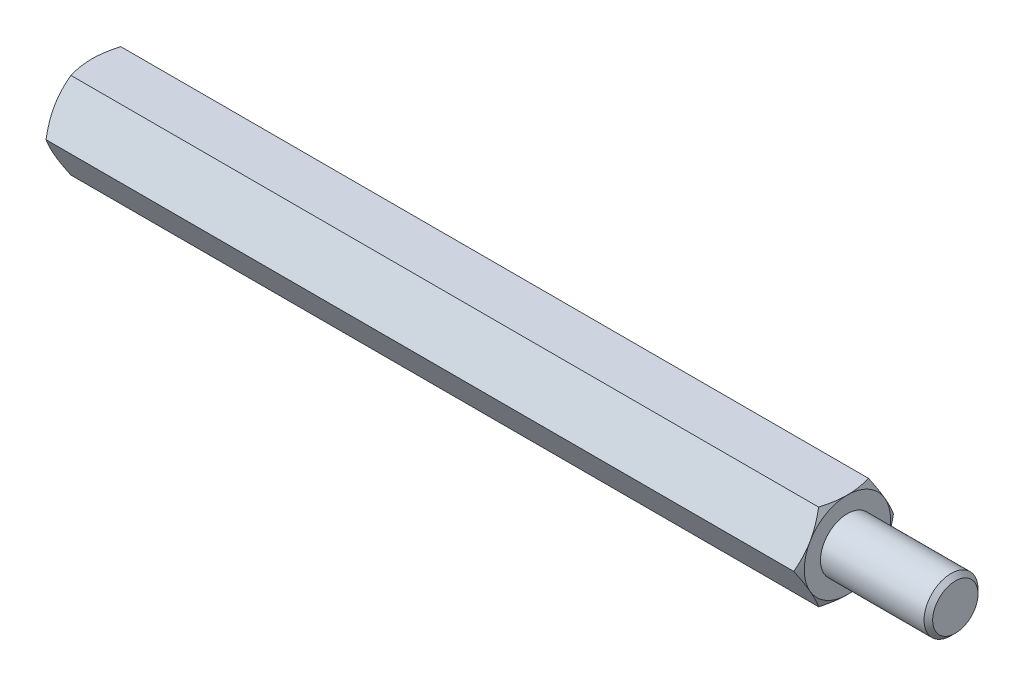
ISO-10303-21;
HEADER;
FILE_DESCRIPTION(('STEP AP214'),'2;1');
FILE_NAME('part.step','',(''),(''),'','','');
FILE_SCHEMA(('AUTOMOTIVE_DESIGN { 1 0 10303 214 1 1 1 1 }'));
ENDSEC;
DATA;
#1=APPLICATION_CONTEXT('core data for automotive mechanical design processes');
#2=APPLICATION_PROTOCOL_DEFINITION('international standard','automotive_design',2000,#1);
#3=PRODUCT_CONTEXT('',#1,'mechanical');
#4=PRODUCT('Part','Part','',(#3));
#5=PRODUCT_RELATED_PRODUCT_CATEGORY('part','',(#4));
#6=PRODUCT_DEFINITION_FORMATION('','',#4);
#7=PRODUCT_DEFINITION_CONTEXT('part definition',#1,'design');
#8=PRODUCT_DEFINITION('design','',#6,#7);
#9=PRODUCT_DEFINITION_SHAPE('','',#8);
#10=(LENGTH_UNIT() NAMED_UNIT(*) SI_UNIT(.MILLI.,.METRE.));
#11=(NAMED_UNIT(*) PLANE_ANGLE_UNIT() SI_UNIT($,.RADIAN.));
#12=(NAMED_UNIT(*) SI_UNIT($,.STERADIAN.) SOLID_ANGLE_UNIT());
#13=UNCERTAINTY_MEASURE_WITH_UNIT(LENGTH_MEASURE(1.E-05),#10,'distance_accuracy_value','');
#14=(GEOMETRIC_REPRESENTATION_CONTEXT(3) GLOBAL_UNCERTAINTY_ASSIGNED_CONTEXT((#13)) GLOBAL_UNIT_ASSIGNED_CONTEXT((#10,
#11,#12)) REPRESENTATION_CONTEXT('',''));
#15=CARTESIAN_POINT('',(0.,0.,0.));
#16=DIRECTION('',(0.,0.,1.));
#17=DIRECTION('',(1.,0.,0.));
#18=AXIS2_PLACEMENT_3D('',#15,#16,#17);
#19=CARTESIAN_POINT('',(35.,4.,-2.3094010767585));
#20=DIRECTION('',(1.,0.,0.));
#21=DIRECTION('',(0.,0.,-1.));
#22=AXIS2_PLACEMENT_3D('',#19,#20,#21);
#23=PLANE('',#22);
#24=CARTESIAN_POINT('',(35.,0.,0.));
#25=DIRECTION('',(1.,0.,0.));
#26=DIRECTION('',(0.,0.,-1.));
#27=AXIS2_PLACEMENT_3D('',#24,#25,#26);
#28=CIRCLE('',#27,4.00000000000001);
#29=CARTESIAN_POINT('',(35.,-2.00000000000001,-3.46410161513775));
#30=VERTEX_POINT('',#29);
#31=CARTESIAN_POINT('',(35.,2.,-3.46410161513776));
#32=VERTEX_POINT('',#31);
#33=EDGE_CURVE('E288',#30,#32,#28,.T.);
#34=ORIENTED_EDGE('',*,*,#33,.T.);
#35=CARTESIAN_POINT('',(35.,4.,0.));
#36=VERTEX_POINT('',#35);
#37=EDGE_CURVE('E53',#32,#36,#28,.T.);
#38=ORIENTED_EDGE('',*,*,#37,.T.);
#39=CARTESIAN_POINT('',(35.,2.,3.46410161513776));
#40=VERTEX_POINT('',#39);
#41=EDGE_CURVE('E297',#36,#40,#28,.T.);
#42=ORIENTED_EDGE('',*,*,#41,.T.);
#43=CARTESIAN_POINT('',(35.,-2.00000000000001,3.46410161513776));
#44=VERTEX_POINT('',#43);
#45=EDGE_CURVE('E303',#40,#44,#28,.T.);
#46=ORIENTED_EDGE('',*,*,#45,.T.);
#47=CARTESIAN_POINT('',(35.,0.,0.));
#48=DIRECTION('',(-1.,0.,0.));
#49=DIRECTION('',(0.,-1.,0.));
#50=AXIS2_PLACEMENT_3D('',#47,#48,#49);
#51=CIRCLE('',#50,4.00000000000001);
#52=CARTESIAN_POINT('',(35.,-4.00000000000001,0.));
#53=VERTEX_POINT('',#52);
#54=EDGE_CURVE('E193',#53,#44,#51,.T.);
#55=ORIENTED_EDGE('',*,*,#54,.F.);
#56=EDGE_CURVE('E61',#53,#30,#28,.T.);
#57=ORIENTED_EDGE('',*,*,#56,.T.);
#58=EDGE_LOOP('',(#34,#38,#42,#46,#55,#57));
#59=FACE_BOUND('',#58,.T.);
#60=CARTESIAN_POINT('',(35.,0.,0.));
#61=DIRECTION('',(1.,0.,0.));
#62=DIRECTION('',(0.,0.,-1.));
#63=AXIS2_PLACEMENT_3D('',#60,#61,#62);
#64=CIRCLE('',#63,2.5);
#65=CARTESIAN_POINT('',(35.,0.,-2.5));
#66=VERTEX_POINT('',#65);
#67=EDGE_CURVE('E384',#66,#66,#64,.T.);
#68=ORIENTED_EDGE('',*,*,#67,.F.);
#69=EDGE_LOOP('',(#68));
#70=FACE_BOUND('',#69,.T.);
#71=ADVANCED_FACE('F37',(#59,#70),#23,.T.);
#72=CARTESIAN_POINT('',(35.,0.,-4.61880215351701));
#73=DIRECTION('',(0.,-0.5,0.866025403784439));
#74=DIRECTION('',(0.,-0.866025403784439,-0.5));
#75=AXIS2_PLACEMENT_3D('',#72,#73,#74);
#76=PLANE('',#75);
#77=CARTESIAN_POINT('',(34.6426677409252,-0.000200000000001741,-4.61891762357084));
#78=CARTESIAN_POINT('',(34.7012821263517,0.175579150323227,-4.5174314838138));
#79=CARTESIAN_POINT('',(34.7545896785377,0.35287561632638,-4.41506932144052));
#80=CARTESIAN_POINT('',(34.8476383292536,0.710538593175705,-4.20857250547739));
#81=CARTESIAN_POINT('',(34.8873465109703,0.890911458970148,-4.10443418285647));
#82=CARTESIAN_POINT('',(34.9491577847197,1.24942181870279,-3.89744813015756));
#83=CARTESIAN_POINT('',(34.9716722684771,1.42750415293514,-3.7946322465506));
#84=CARTESIAN_POINT('',(34.9985493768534,1.7845067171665,-3.58851671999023));
#85=CARTESIAN_POINT('',(35.0029342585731,1.9634256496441,-3.48521782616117));
#86=CARTESIAN_POINT('',(34.99380992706,2.29774284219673,-3.29219970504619));
#87=CARTESIAN_POINT('',(34.982541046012,2.45319115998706,-3.20245157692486));
#88=CARTESIAN_POINT('',(34.9468260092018,2.76307505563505,-3.02354002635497));
#89=CARTESIAN_POINT('',(34.9223676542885,2.91750956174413,-2.93437722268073));
#90=CARTESIAN_POINT('',(34.8612239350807,3.22803232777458,-2.75509682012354));
#91=CARTESIAN_POINT('',(34.8242793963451,3.3840812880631,-2.6650019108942));
#92=CARTESIAN_POINT('',(34.740429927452,3.69385183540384,-2.486155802));
#93=CARTESIAN_POINT('',(34.6935446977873,3.84757739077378,-2.39740231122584));
#94=CARTESIAN_POINT('',(34.6426677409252,4.0002,-2.30928560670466));
#95=B_SPLINE_CURVE_WITH_KNOTS('',3,(#77,#78,#79,#80,#81,#82,#83,#84,#85,#86,#87,#88,#89,#90,#91,
#92,#93,#94),.UNSPECIFIED.,.F.,.F.,(4,2,2,2,2,2,2,2,4),(0.,0.634047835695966,1.26961969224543,
1.88946157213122,2.50854226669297,3.04757825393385,3.58711366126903,4.13861653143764,
4.68903648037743),.UNSPECIFIED.);
#96=CARTESIAN_POINT('',(34.6427344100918,0.,-4.61880215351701));
#97=VERTEX_POINT('',#96);
#98=EDGE_CURVE('E345',#97,#32,#95,.T.);
#99=ORIENTED_EDGE('',*,*,#98,.F.);
#100=DIRECTION('',(-1.,0.,0.));
#101=VECTOR('',#100,1.);
#102=CARTESIAN_POINT('',(35.,0.,-4.61880215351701));
#103=LINE('',#102,#101);
#104=CARTESIAN_POINT('',(-34.6427344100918,0.,-4.61880215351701));
#105=VERTEX_POINT('',#104);
#106=EDGE_CURVE('E264',#97,#105,#103,.T.);
#107=ORIENTED_EDGE('',*,*,#106,.T.);
#108=CARTESIAN_POINT('',(-34.6426677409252,4.0002,-2.30928560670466));
#109=CARTESIAN_POINT('',(-34.7012821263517,3.82442084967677,-2.4107717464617));
#110=CARTESIAN_POINT('',(-34.7545896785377,3.64712438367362,-2.51313390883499));
#111=CARTESIAN_POINT('',(-34.8476383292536,3.28946140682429,-2.71963072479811));
#112=CARTESIAN_POINT('',(-34.8873465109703,3.10908854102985,-2.82376904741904));
#113=CARTESIAN_POINT('',(-34.9491577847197,2.75057818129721,-3.03075510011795));
#114=CARTESIAN_POINT('',(-34.9716722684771,2.57249584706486,-3.13357098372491));
#115=CARTESIAN_POINT('',(-34.9985493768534,2.21549328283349,-3.33968651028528));
#116=CARTESIAN_POINT('',(-35.0029342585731,2.0365743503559,-3.44298540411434));
#117=CARTESIAN_POINT('',(-34.99380992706,1.70225715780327,-3.63600352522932));
#118=CARTESIAN_POINT('',(-34.982541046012,1.54680884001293,-3.72575165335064));
#119=CARTESIAN_POINT('',(-34.9468260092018,1.23692494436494,-3.90466320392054));
#120=CARTESIAN_POINT('',(-34.9223676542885,1.08249043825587,-3.99382600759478));
#121=CARTESIAN_POINT('',(-34.8612239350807,0.771967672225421,-4.17310641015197));
#122=CARTESIAN_POINT('',(-34.8242793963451,0.615918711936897,-4.26320131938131));
#123=CARTESIAN_POINT('',(-34.740429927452,0.30614816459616,-4.4420474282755));
#124=CARTESIAN_POINT('',(-34.6935446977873,0.152422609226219,-4.53080091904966));
#125=CARTESIAN_POINT('',(-34.6426677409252,-0.000200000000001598,-4.61891762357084));
#126=B_SPLINE_CURVE_WITH_KNOTS('',3,(#108,#109,#110,#111,#112,#113,#114,#115,#116,#117,#118,
#119,#120,#121,#122,#123,#124,#125),.UNSPECIFIED.,.F.,.F.,(4,2,2,2,2,2,2,2,4),(0.,
0.634047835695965,1.26961969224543,1.88946157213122,2.50854226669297,3.04757825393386,
3.58711366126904,4.13861653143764,4.68903648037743),.UNSPECIFIED.);
#127=CARTESIAN_POINT('',(-35.,2.,-3.46410161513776));
#128=VERTEX_POINT('',#127);
#129=EDGE_CURVE('E408',#128,#105,#126,.T.);
#130=ORIENTED_EDGE('',*,*,#129,.F.);
#131=CARTESIAN_POINT('',(-34.6427344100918,4.,-2.3094010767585));
#132=VERTEX_POINT('',#131);
#133=EDGE_CURVE('E406',#132,#128,#126,.T.);
#134=ORIENTED_EDGE('',*,*,#133,.F.);
#135=DIRECTION('',(-1.,0.,0.));
#136=VECTOR('',#135,1.);
#137=CARTESIAN_POINT('',(35.,4.,-2.3094010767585));
#138=LINE('',#137,#136);
#139=CARTESIAN_POINT('',(34.642734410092,4.,-2.30940107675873));
#140=VERTEX_POINT('',#139);
#141=EDGE_CURVE('E279',#140,#132,#138,.T.);
#142=ORIENTED_EDGE('',*,*,#141,.F.);
#143=EDGE_CURVE('E229',#32,#140,#95,.T.);
#144=ORIENTED_EDGE('',*,*,#143,.F.);
#145=EDGE_LOOP('',(#99,#107,#130,#134,#142,#144));
#146=FACE_BOUND('',#145,.T.);
#147=ADVANCED_FACE('F148',(#146),#76,.F.);
#148=CARTESIAN_POINT('',(35.,4.,-2.3094010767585));
#149=DIRECTION('',(0.,-1.,0.));
#150=DIRECTION('',(0.,0.,-1.));
#151=AXIS2_PLACEMENT_3D('',#148,#149,#150);
#152=PLANE('',#151);
#153=CARTESIAN_POINT('',(33.0082907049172,4.,-6.28479524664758));
#154=CARTESIAN_POINT('',(33.0937006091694,4.,-6.1093934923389));
#155=CARTESIAN_POINT('',(33.1783148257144,4.,-5.93359774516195));
#156=CARTESIAN_POINT('',(33.3455059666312,4.,-5.58100905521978));
#157=CARTESIAN_POINT('',(33.4280825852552,4.,-5.40421596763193));
#158=CARTESIAN_POINT('',(33.5911508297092,4.,-5.0485508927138));
#159=CARTESIAN_POINT('',(33.6716293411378,4.,-4.86967287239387));
#160=CARTESIAN_POINT('',(33.829400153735,4.,-4.51052237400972));
#161=CARTESIAN_POINT('',(33.906692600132,4.,-4.33024995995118));
#162=CARTESIAN_POINT('',(34.059802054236,4.,-3.9618911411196));
#163=CARTESIAN_POINT('',(34.135480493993,4.,-3.77374683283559));
#164=CARTESIAN_POINT('',(34.2813045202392,4.,-3.39528725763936));
#165=CARTESIAN_POINT('',(34.3514494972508,4.,-3.20497175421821));
#166=CARTESIAN_POINT('',(34.4844245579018,4.,-2.82219775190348));
#167=CARTESIAN_POINT('',(34.5472687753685,4.,-2.62974421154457));
#168=CARTESIAN_POINT('',(34.6636796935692,4.,-2.24207725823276));
#169=CARTESIAN_POINT('',(34.7172492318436,4.,-2.04686470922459));
#170=CARTESIAN_POINT('',(34.8123031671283,4.,-1.65467425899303));
#171=CARTESIAN_POINT('',(34.8538563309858,4.,-1.45771333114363));
#172=CARTESIAN_POINT('',(34.9225903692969,4.,-1.06125849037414));
#173=CARTESIAN_POINT('',(34.9497727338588,4.,-0.861764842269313));
#174=CARTESIAN_POINT('',(34.9872447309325,4.,-0.463879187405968));
#175=CARTESIAN_POINT('',(34.9977578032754,4.,-0.265508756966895));
#176=CARTESIAN_POINT('',(35.0015934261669,4.,0.131417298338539));
#177=CARTESIAN_POINT('',(34.9949158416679,4.,0.329972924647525));
#178=CARTESIAN_POINT('',(34.9696489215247,4.,0.664692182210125));
#179=CARTESIAN_POINT('',(34.9553708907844,4.,0.8012029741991));
#180=CARTESIAN_POINT('',(34.9195349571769,4.,1.07327201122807));
#181=CARTESIAN_POINT('',(34.8979761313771,4.,1.20883013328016));
#182=CARTESIAN_POINT('',(34.8235066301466,4.,1.61386939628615));
#183=CARTESIAN_POINT('',(34.7608149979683,4.,1.88157484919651));
#184=CARTESIAN_POINT('',(34.6515117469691,4.,2.28197262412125));
#185=CARTESIAN_POINT('',(34.612009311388,4.,2.41672443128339));
#186=CARTESIAN_POINT('',(34.5287523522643,4.,2.68492067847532));
#187=CARTESIAN_POINT('',(34.4849977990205,4.,2.81836510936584));
#188=CARTESIAN_POINT('',(34.3939510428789,4.,3.08398596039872));
#189=CARTESIAN_POINT('',(34.346659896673,4.,3.21616274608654));
#190=CARTESIAN_POINT('',(34.2491111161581,4.,3.47941134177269));
#191=CARTESIAN_POINT('',(34.1988535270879,4.,3.61048316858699));
#192=CARTESIAN_POINT('',(34.0713295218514,4.,3.93385125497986));
#193=CARTESIAN_POINT('',(33.9926014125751,4.,4.12557021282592));
#194=CARTESIAN_POINT('',(33.8309693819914,4.,4.50724553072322));
#195=CARTESIAN_POINT('',(33.7480651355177,4.,4.69720175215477));
#196=CARTESIAN_POINT('',(33.5789699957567,4.,5.07569950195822));
#197=CARTESIAN_POINT('',(33.4927782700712,4.,5.26424065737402));
#198=CARTESIAN_POINT('',(33.3178011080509,4.,5.64011758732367));
#199=CARTESIAN_POINT('',(33.2290156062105,4.,5.82745333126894));
#200=CARTESIAN_POINT('',(32.9593432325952,4.,6.38844423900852));
#201=CARTESIAN_POINT('',(32.7753561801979,4.,6.76060781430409));
#202=CARTESIAN_POINT('',(32.4019562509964,4.,7.50211228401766));
#203=CARTESIAN_POINT('',(32.2125442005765,4.,7.87145359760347));
#204=CARTESIAN_POINT('',(31.8473877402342,4.,8.57450173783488));
#205=CARTESIAN_POINT('',(31.671975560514,4.,8.90838144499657));
#206=CARTESIAN_POINT('',(31.3188097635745,4.,9.57491712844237));
#207=CARTESIAN_POINT('',(31.1410560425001,4.,9.90757304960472));
#208=CARTESIAN_POINT('',(30.7842933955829,4.,10.5709822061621));
#209=CARTESIAN_POINT('',(30.6052895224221,3.99999999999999,10.9017381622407));
#210=CARTESIAN_POINT('',(30.2459071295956,3.99999999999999,11.5624752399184));
#211=CARTESIAN_POINT('',(30.0655286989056,3.99999999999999,11.8924564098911));
#212=CARTESIAN_POINT('',(29.884642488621,3.99999999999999,12.2221569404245));
#213=B_SPLINE_CURVE_WITH_KNOTS('',3,(#153,#154,#155,#156,#157,#158,#159,#160,#161,#162,#163,
#164,#165,#166,#167,#168,#169,#170,#171,#172,#173,#174,#175,#176,#177,#178,#179,#180,#181,#182,
#183,#184,#185,#186,#187,#188,#189,#190,#191,#192,#193,#194,#195,#196,#197,#198,#199,#200,#201,
#202,#203,#204,#205,#206,#207,#208,#209,#210,#211,#212),.UNSPECIFIED.,.F.,.F.,(4,2,2,2,2,2,2,2,
2,2,2,2,2,2,2,2,2,2,2,2,2,2,2,2,2,2,2,2,2,4),(0.,0.58528075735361,1.17064881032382,
1.75906864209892,2.34746162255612,2.95577704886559,3.56415938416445,4.17134357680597,
4.77834167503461,5.38179402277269,5.98518378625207,6.5804150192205,7.17565092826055,
7.58721910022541,7.99883946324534,8.82250155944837,9.24373134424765,9.66496407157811,
10.086071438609,10.5071723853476,11.1288656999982,11.7506074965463,12.3725077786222,
12.9944237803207,14.2398211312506,15.4850297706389,16.6164791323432,17.7479788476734,
18.8762380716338,20.0044248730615),.UNSPECIFIED.);
#214=EDGE_CURVE('E227',#140,#36,#213,.T.);
#215=ORIENTED_EDGE('',*,*,#214,.F.);
#216=ORIENTED_EDGE('',*,*,#141,.T.);
#217=CARTESIAN_POINT('',(-33.0082907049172,4.,-6.28479524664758));
#218=CARTESIAN_POINT('',(-33.0937006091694,4.,-6.1093934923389));
#219=CARTESIAN_POINT('',(-33.1783148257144,4.,-5.93359774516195));
#220=CARTESIAN_POINT('',(-33.3455059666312,4.,-5.58100905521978));
#221=CARTESIAN_POINT('',(-33.4280825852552,4.,-5.40421596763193));
#222=CARTESIAN_POINT('',(-33.5911508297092,4.,-5.0485508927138));
#223=CARTESIAN_POINT('',(-33.6716293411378,4.,-4.86967287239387));
#224=CARTESIAN_POINT('',(-33.829400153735,4.,-4.51052237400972));
#225=CARTESIAN_POINT('',(-33.906692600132,4.,-4.33024995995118));
#226=CARTESIAN_POINT('',(-34.059802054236,4.,-3.9618911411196));
#227=CARTESIAN_POINT('',(-34.135480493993,4.,-3.77374683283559));
#228=CARTESIAN_POINT('',(-34.2813045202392,4.,-3.39528725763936));
#229=CARTESIAN_POINT('',(-34.3514494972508,4.,-3.20497175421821));
#230=CARTESIAN_POINT('',(-34.4844245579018,4.,-2.82219775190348));
#231=CARTESIAN_POINT('',(-34.5472687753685,4.,-2.62974421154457));
#232=CARTESIAN_POINT('',(-34.6636796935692,4.,-2.24207725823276));
#233=CARTESIAN_POINT('',(-34.7172492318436,4.,-2.04686470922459));
#234=CARTESIAN_POINT('',(-34.8123031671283,4.,-1.65467425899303));
#235=CARTESIAN_POINT('',(-34.8538563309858,4.,-1.45771333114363));
#236=CARTESIAN_POINT('',(-34.9225903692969,4.,-1.06125849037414));
#237=CARTESIAN_POINT('',(-34.9497727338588,4.,-0.861764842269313));
#238=CARTESIAN_POINT('',(-34.9872447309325,4.,-0.463879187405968));
#239=CARTESIAN_POINT('',(-34.9977578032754,4.,-0.265508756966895));
#240=CARTESIAN_POINT('',(-35.0015934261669,4.,0.131417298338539));
#241=CARTESIAN_POINT('',(-34.9949158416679,4.,0.329972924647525));
#242=CARTESIAN_POINT('',(-34.9696489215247,4.,0.664692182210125));
#243=CARTESIAN_POINT('',(-34.9553708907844,4.,0.8012029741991));
#244=CARTESIAN_POINT('',(-34.9195349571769,4.,1.07327201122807));
#245=CARTESIAN_POINT('',(-34.8979761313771,4.,1.20883013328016));
#246=CARTESIAN_POINT('',(-34.8235066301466,4.,1.61386939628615));
#247=CARTESIAN_POINT('',(-34.7608149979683,4.,1.88157484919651));
#248=CARTESIAN_POINT('',(-34.6515117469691,4.,2.28197262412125));
#249=CARTESIAN_POINT('',(-34.612009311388,4.,2.41672443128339));
#250=CARTESIAN_POINT('',(-34.5287523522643,4.,2.68492067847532));
#251=CARTESIAN_POINT('',(-34.4849977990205,4.,2.81836510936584));
#252=CARTESIAN_POINT('',(-34.3939510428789,4.,3.08398596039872));
#253=CARTESIAN_POINT('',(-34.346659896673,4.,3.21616274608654));
#254=CARTESIAN_POINT('',(-34.2491111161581,4.,3.47941134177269));
#255=CARTESIAN_POINT('',(-34.1988535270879,4.,3.61048316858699));
#256=CARTESIAN_POINT('',(-34.0713295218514,4.,3.93385125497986));
#257=CARTESIAN_POINT('',(-33.9926014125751,4.,4.12557021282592));
#258=CARTESIAN_POINT('',(-33.8309693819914,4.,4.50724553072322));
#259=CARTESIAN_POINT('',(-33.7480651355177,4.,4.69720175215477));
#260=CARTESIAN_POINT('',(-33.5789699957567,4.,5.07569950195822));
#261=CARTESIAN_POINT('',(-33.4927782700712,4.,5.26424065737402));
#262=CARTESIAN_POINT('',(-33.3178011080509,4.,5.64011758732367));
#263=CARTESIAN_POINT('',(-33.2290156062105,4.,5.82745333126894));
#264=CARTESIAN_POINT('',(-32.9593432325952,4.,6.38844423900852));
#265=CARTESIAN_POINT('',(-32.7753561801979,4.,6.76060781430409));
#266=CARTESIAN_POINT('',(-32.4019562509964,4.,7.50211228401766));
#267=CARTESIAN_POINT('',(-32.2125442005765,4.,7.87145359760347));
#268=CARTESIAN_POINT('',(-31.8473877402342,4.,8.57450173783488));
#269=CARTESIAN_POINT('',(-31.671975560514,4.,8.90838144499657));
#270=CARTESIAN_POINT('',(-31.3188097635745,4.,9.57491712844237));
#271=CARTESIAN_POINT('',(-31.1410560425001,4.,9.90757304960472));
#272=CARTESIAN_POINT('',(-30.7842933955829,4.,10.5709822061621));
#273=CARTESIAN_POINT('',(-30.6052895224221,3.99999999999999,10.9017381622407));
#274=CARTESIAN_POINT('',(-30.2459071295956,3.99999999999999,11.5624752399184));
#275=CARTESIAN_POINT('',(-30.0655286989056,3.99999999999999,11.8924564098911));
#276=CARTESIAN_POINT('',(-29.884642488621,3.99999999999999,12.2221569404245));
#277=B_SPLINE_CURVE_WITH_KNOTS('',3,(#217,#218,#219,#220,#221,#222,#223,#224,#225,#226,#227,
#228,#229,#230,#231,#232,#233,#234,#235,#236,#237,#238,#239,#240,#241,#242,#243,#244,#245,#246,
#247,#248,#249,#250,#251,#252,#253,#254,#255,#256,#257,#258,#259,#260,#261,#262,#263,#264,#265,
#266,#267,#268,#269,#270,#271,#272,#273,#274,#275,#276),.UNSPECIFIED.,.F.,.F.,(4,2,2,2,2,2,2,2,
2,2,2,2,2,2,2,2,2,2,2,2,2,2,2,2,2,2,2,2,2,4),(0.,0.58528075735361,1.17064881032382,
1.75906864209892,2.34746162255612,2.95577704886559,3.56415938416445,4.17134357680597,
4.77834167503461,5.38179402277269,5.98518378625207,6.5804150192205,7.17565092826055,
7.58721910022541,7.99883946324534,8.82250155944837,9.24373134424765,9.66496407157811,
10.086071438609,10.5071723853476,11.1288656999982,11.7506074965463,12.3725077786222,
12.9944237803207,14.2398211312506,15.4850297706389,16.6164791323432,17.7479788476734,
18.8762380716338,20.0044248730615),.UNSPECIFIED.);
#278=CARTESIAN_POINT('',(-35.,4.,0.));
#279=VERTEX_POINT('',#278);
#280=EDGE_CURVE('E241',#279,#132,#277,.F.);
#281=ORIENTED_EDGE('',*,*,#280,.F.);
#282=CARTESIAN_POINT('',(-34.6427344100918,4.,2.3094010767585));
#283=VERTEX_POINT('',#282);
#284=EDGE_CURVE('E249',#283,#279,#277,.F.);
#285=ORIENTED_EDGE('',*,*,#284,.F.);
#286=DIRECTION('',(-1.,0.,0.));
#287=VECTOR('',#286,1.);
#288=CARTESIAN_POINT('',(35.,4.,2.3094010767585));
#289=LINE('',#288,#287);
#290=CARTESIAN_POINT('',(34.6427344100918,4.,2.3094010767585));
#291=VERTEX_POINT('',#290);
#292=EDGE_CURVE('E276',#291,#283,#289,.T.);
#293=ORIENTED_EDGE('',*,*,#292,.F.);
#294=EDGE_CURVE('E221',#36,#291,#213,.T.);
#295=ORIENTED_EDGE('',*,*,#294,.F.);
#296=EDGE_LOOP('',(#215,#216,#281,#285,#293,#295));
#297=FACE_BOUND('',#296,.T.);
#298=ADVANCED_FACE('F153',(#297),#152,.F.);
#299=CARTESIAN_POINT('',(35.,4.,2.3094010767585));
#300=DIRECTION('',(0.,-0.5,-0.866025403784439));
#301=DIRECTION('',(0.,0.866025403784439,-0.5));
#302=AXIS2_PLACEMENT_3D('',#299,#300,#301);
#303=PLANE('',#302);
#304=CARTESIAN_POINT('',(34.6426677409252,4.0002,2.30928560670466));
#305=CARTESIAN_POINT('',(34.7012821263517,3.82442084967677,2.4107717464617));
#306=CARTESIAN_POINT('',(34.7545896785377,3.64712438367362,2.51313390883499));
#307=CARTESIAN_POINT('',(34.8476383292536,3.28946140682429,2.71963072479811));
#308=CARTESIAN_POINT('',(34.8873465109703,3.10908854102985,2.82376904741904));
#309=CARTESIAN_POINT('',(34.9491577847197,2.75057818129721,3.03075510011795));
#310=CARTESIAN_POINT('',(34.9716722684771,2.57249584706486,3.13357098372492));
#311=CARTESIAN_POINT('',(34.9985493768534,2.21549328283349,3.33968651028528));
#312=CARTESIAN_POINT('',(35.0029342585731,2.0365743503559,3.44298540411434));
#313=CARTESIAN_POINT('',(34.99380992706,1.70225715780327,3.63600352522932));
#314=CARTESIAN_POINT('',(34.982541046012,1.54680884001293,3.72575165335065));
#315=CARTESIAN_POINT('',(34.9468260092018,1.23692494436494,3.90466320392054));
#316=CARTESIAN_POINT('',(34.9223676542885,1.08249043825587,3.99382600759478));
#317=CARTESIAN_POINT('',(34.8612239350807,0.771967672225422,4.17310641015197));
#318=CARTESIAN_POINT('',(34.8242793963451,0.615918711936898,4.26320131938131));
#319=CARTESIAN_POINT('',(34.740429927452,0.306148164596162,4.4420474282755));
#320=CARTESIAN_POINT('',(34.6935446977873,0.152422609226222,4.53080091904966));
#321=CARTESIAN_POINT('',(34.6426677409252,-0.000199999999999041,4.61891762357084));
#322=B_SPLINE_CURVE_WITH_KNOTS('',3,(#304,#305,#306,#307,#308,#309,#310,#311,#312,#313,#314,
#315,#316,#317,#318,#319,#320,#321),.UNSPECIFIED.,.F.,.F.,(4,2,2,2,2,2,2,2,4),(0.,
0.634047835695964,1.26961969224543,1.88946157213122,2.50854226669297,3.04757825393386,
3.58711366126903,4.13861653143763,4.68903648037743),.UNSPECIFIED.);
#323=EDGE_CURVE('E228',#291,#40,#322,.T.);
#324=ORIENTED_EDGE('',*,*,#323,.F.);
#325=ORIENTED_EDGE('',*,*,#292,.T.);
#326=CARTESIAN_POINT('',(-34.6426677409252,-0.000199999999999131,4.61891762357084));
#327=CARTESIAN_POINT('',(-34.7012821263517,0.17557915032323,4.5174314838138));
#328=CARTESIAN_POINT('',(-34.7545896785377,0.352875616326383,4.41506932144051));
#329=CARTESIAN_POINT('',(-34.8476383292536,0.710538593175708,4.20857250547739));
#330=CARTESIAN_POINT('',(-34.8873465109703,0.890911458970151,4.10443418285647));
#331=CARTESIAN_POINT('',(-34.9491577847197,1.24942181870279,3.89744813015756));
#332=CARTESIAN_POINT('',(-34.9716722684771,1.42750415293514,3.79463224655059));
#333=CARTESIAN_POINT('',(-34.9985493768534,1.78450671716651,3.58851671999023));
#334=CARTESIAN_POINT('',(-35.0029342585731,1.9634256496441,3.48521782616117));
#335=CARTESIAN_POINT('',(-34.99380992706,2.29774284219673,3.29219970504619));
#336=CARTESIAN_POINT('',(-34.982541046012,2.45319115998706,3.20245157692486));
#337=CARTESIAN_POINT('',(-34.9468260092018,2.76307505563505,3.02354002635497));
#338=CARTESIAN_POINT('',(-34.9223676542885,2.91750956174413,2.93437722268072));
#339=CARTESIAN_POINT('',(-34.8612239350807,3.22803232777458,2.75509682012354));
#340=CARTESIAN_POINT('',(-34.8242793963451,3.3840812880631,2.6650019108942));
#341=CARTESIAN_POINT('',(-34.740429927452,3.69385183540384,2.48615580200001));
#342=CARTESIAN_POINT('',(-34.6935446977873,3.84757739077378,2.39740231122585));
#343=CARTESIAN_POINT('',(-34.6426677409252,4.0002,2.30928560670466));
#344=B_SPLINE_CURVE_WITH_KNOTS('',3,(#326,#327,#328,#329,#330,#331,#332,#333,#334,#335,#336,
#337,#338,#339,#340,#341,#342,#343),.UNSPECIFIED.,.F.,.F.,(4,2,2,2,2,2,2,2,4),(0.,
0.634047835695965,1.26961969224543,1.88946157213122,2.50854226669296,3.04757825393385,
3.58711366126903,4.13861653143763,4.68903648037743),.UNSPECIFIED.);
#345=CARTESIAN_POINT('',(-35.,2.,3.46410161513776));
#346=VERTEX_POINT('',#345);
#347=EDGE_CURVE('E255',#346,#283,#344,.T.);
#348=ORIENTED_EDGE('',*,*,#347,.F.);
#349=CARTESIAN_POINT('',(-34.6427344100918,0.,4.618802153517));
#350=VERTEX_POINT('',#349);
#351=EDGE_CURVE('E262',#350,#346,#344,.T.);
#352=ORIENTED_EDGE('',*,*,#351,.F.);
#353=DIRECTION('',(-1.,0.,0.));
#354=VECTOR('',#353,1.);
#355=CARTESIAN_POINT('',(35.,0.,4.618802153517));
#356=LINE('',#355,#354);
#357=CARTESIAN_POINT('',(34.6427344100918,0.,4.618802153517));
#358=VERTEX_POINT('',#357);
#359=EDGE_CURVE('E273',#358,#350,#356,.T.);
#360=ORIENTED_EDGE('',*,*,#359,.F.);
#361=EDGE_CURVE('E215',#40,#358,#322,.T.);
#362=ORIENTED_EDGE('',*,*,#361,.F.);
#363=EDGE_LOOP('',(#324,#325,#348,#352,#360,#362));
#364=FACE_BOUND('',#363,.T.);
#365=ADVANCED_FACE('F235',(#364),#303,.F.);
#366=CARTESIAN_POINT('',(35.,0.,4.618802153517));
#367=DIRECTION('',(0.,0.5,-0.866025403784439));
#368=DIRECTION('',(0.,0.866025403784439,0.5));
#369=AXIS2_PLACEMENT_3D('',#366,#367,#368);
#370=PLANE('',#369);
#371=CARTESIAN_POINT('',(34.6426677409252,0.000200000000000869,4.61891762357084));
#372=CARTESIAN_POINT('',(34.7012821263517,-0.175579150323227,4.5174314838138));
#373=CARTESIAN_POINT('',(34.7545896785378,-0.35287561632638,4.41506932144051));
#374=CARTESIAN_POINT('',(34.8476383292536,-0.710538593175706,4.20857250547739));
#375=CARTESIAN_POINT('',(34.8873465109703,-0.890911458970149,4.10443418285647));
#376=CARTESIAN_POINT('',(34.9491577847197,-1.24942181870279,3.89744813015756));
#377=CARTESIAN_POINT('',(34.9716722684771,-1.42750415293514,3.79463224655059));
#378=CARTESIAN_POINT('',(34.9985493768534,-1.7845067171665,3.58851671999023));
#379=CARTESIAN_POINT('',(35.0029342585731,-1.9634256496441,3.48521782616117));
#380=CARTESIAN_POINT('',(34.99380992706,-2.29774284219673,3.29219970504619));
#381=CARTESIAN_POINT('',(34.982541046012,-2.45319115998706,3.20245157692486));
#382=CARTESIAN_POINT('',(34.9468260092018,-2.76307505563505,3.02354002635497));
#383=CARTESIAN_POINT('',(34.9223676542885,-2.91750956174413,2.93437722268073));
#384=CARTESIAN_POINT('',(34.8612239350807,-3.22803232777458,2.75509682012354));
#385=CARTESIAN_POINT('',(34.8242793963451,-3.3840812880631,2.6650019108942));
#386=CARTESIAN_POINT('',(34.740429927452,-3.69385183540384,2.48615580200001));
#387=CARTESIAN_POINT('',(34.6935446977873,-3.84757739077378,2.39740231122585));
#388=CARTESIAN_POINT('',(34.6426677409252,-4.0002,2.30928560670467));
#389=B_SPLINE_CURVE_WITH_KNOTS('',3,(#371,#372,#373,#374,#375,#376,#377,#378,#379,#380,#381,
#382,#383,#384,#385,#386,#387,#388),.UNSPECIFIED.,.F.,.F.,(4,2,2,2,2,2,2,2,4),(0.,
0.634047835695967,1.26961969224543,1.88946157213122,2.50854226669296,3.04757825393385,
3.58711366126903,4.13861653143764,4.68903648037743),.UNSPECIFIED.);
#390=EDGE_CURVE('E366',#358,#44,#389,.T.);
#391=ORIENTED_EDGE('',*,*,#390,.F.);
#392=ORIENTED_EDGE('',*,*,#359,.T.);
#393=CARTESIAN_POINT('',(-34.6426677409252,-4.0002,2.30928560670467));
#394=CARTESIAN_POINT('',(-34.7012821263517,-3.82442084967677,2.4107717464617));
#395=CARTESIAN_POINT('',(-34.7545896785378,-3.64712438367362,2.51313390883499));
#396=CARTESIAN_POINT('',(-34.8476383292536,-3.28946140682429,2.71963072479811));
#397=CARTESIAN_POINT('',(-34.8873465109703,-3.10908854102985,2.82376904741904));
#398=CARTESIAN_POINT('',(-34.9491577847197,-2.75057818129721,3.03075510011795));
#399=CARTESIAN_POINT('',(-34.9716722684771,-2.57249584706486,3.13357098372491));
#400=CARTESIAN_POINT('',(-34.9985493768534,-2.21549328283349,3.33968651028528));
#401=CARTESIAN_POINT('',(-35.0029342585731,-2.0365743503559,3.44298540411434));
#402=CARTESIAN_POINT('',(-34.99380992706,-1.70225715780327,3.63600352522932));
#403=CARTESIAN_POINT('',(-34.982541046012,-1.54680884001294,3.72575165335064));
#404=CARTESIAN_POINT('',(-34.9468260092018,-1.23692494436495,3.90466320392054));
#405=CARTESIAN_POINT('',(-34.9223676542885,-1.08249043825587,3.99382600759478));
#406=CARTESIAN_POINT('',(-34.8612239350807,-0.771967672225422,4.17310641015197));
#407=CARTESIAN_POINT('',(-34.8242793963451,-0.615918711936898,4.26320131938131));
#408=CARTESIAN_POINT('',(-34.740429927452,-0.306148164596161,4.4420474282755));
#409=CARTESIAN_POINT('',(-34.6935446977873,-0.152422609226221,4.53080091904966));
#410=CARTESIAN_POINT('',(-34.6426677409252,0.000200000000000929,4.61891762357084));
#411=B_SPLINE_CURVE_WITH_KNOTS('',3,(#393,#394,#395,#396,#397,#398,#399,#400,#401,#402,#403,
#404,#405,#406,#407,#408,#409,#410),.UNSPECIFIED.,.F.,.F.,(4,2,2,2,2,2,2,2,4),(0.,
0.634047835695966,1.26961969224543,1.88946157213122,2.50854226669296,3.04757825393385,
3.58711366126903,4.13861653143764,4.68903648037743),.UNSPECIFIED.);
#412=CARTESIAN_POINT('',(-35.,-2.00000000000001,3.46410161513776));
#413=VERTEX_POINT('',#412);
#414=EDGE_CURVE('E263',#413,#350,#411,.T.);
#415=ORIENTED_EDGE('',*,*,#414,.F.);
#416=CARTESIAN_POINT('',(-34.6427344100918,-4.,2.3094010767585));
#417=VERTEX_POINT('',#416);
#418=EDGE_CURVE('E250',#417,#413,#411,.T.);
#419=ORIENTED_EDGE('',*,*,#418,.F.);
#420=DIRECTION('',(-1.,0.,0.));
#421=VECTOR('',#420,1.);
#422=CARTESIAN_POINT('',(35.,-4.,2.3094010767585));
#423=LINE('',#422,#421);
#424=CARTESIAN_POINT('',(34.6427344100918,-4.,2.3094010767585));
#425=VERTEX_POINT('',#424);
#426=EDGE_CURVE('E270',#425,#417,#423,.T.);
#427=ORIENTED_EDGE('',*,*,#426,.F.);
#428=EDGE_CURVE('E210',#44,#425,#389,.T.);
#429=ORIENTED_EDGE('',*,*,#428,.F.);
#430=EDGE_LOOP('',(#391,#392,#415,#419,#427,#429));
#431=FACE_BOUND('',#430,.T.);
#432=ADVANCED_FACE('F425',(#431),#370,.F.);
#433=CARTESIAN_POINT('',(35.,-4.,2.3094010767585));
#434=DIRECTION('',(0.,1.,0.));
#435=DIRECTION('',(0.,0.,1.));
#436=AXIS2_PLACEMENT_3D('',#433,#434,#435);
#437=PLANE('',#436);
#438=CARTESIAN_POINT('',(33.0082907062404,-4.,-6.28479524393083));
#439=CARTESIAN_POINT('',(33.0937006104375,-4.,-6.10939348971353));
#440=CARTESIAN_POINT('',(33.1783148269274,-4.,-5.93359774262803));
#441=CARTESIAN_POINT('',(33.3455059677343,-4.,-5.58100905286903));
#442=CARTESIAN_POINT('',(33.4280825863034,-4.,-5.40421596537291));
#443=CARTESIAN_POINT('',(33.5911508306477,-4.,-5.04855089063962));
#444=CARTESIAN_POINT('',(33.6716293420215,-4.,-4.8696728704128));
#445=CARTESIAN_POINT('',(33.8294001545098,-4.,-4.51052237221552));
#446=CARTESIAN_POINT('',(33.9066926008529,-4.,-4.33024995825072));
#447=CARTESIAN_POINT('',(34.0598020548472,-4.,-3.96189113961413));
#448=CARTESIAN_POINT('',(34.1354804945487,-4.,-3.77374683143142));
#449=CARTESIAN_POINT('',(34.2813045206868,-4.,-3.39528725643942));
#450=CARTESIAN_POINT('',(34.3514494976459,-4.,-3.2049717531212));
#451=CARTESIAN_POINT('',(34.4844245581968,-4.,-2.82219775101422));
#452=CARTESIAN_POINT('',(34.5472687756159,-4.,-2.62974421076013));
#453=CARTESIAN_POINT('',(34.6636796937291,-4.,-2.24207725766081));
#454=CARTESIAN_POINT('',(34.7172492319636,-4.,-2.04686470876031));
#455=CARTESIAN_POINT('',(34.8123031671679,-4.,-1.65467425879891));
#456=CARTESIAN_POINT('',(34.8538563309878,-4.,-1.45771333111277));
#457=CARTESIAN_POINT('',(34.9225903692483,-4.,-1.06125849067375));
#458=CARTESIAN_POINT('',(34.9497727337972,-4.,-0.861764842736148));
#459=CARTESIAN_POINT('',(34.9872447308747,-4.,-0.46387918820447));
#460=CARTESIAN_POINT('',(34.9977578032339,-4.,-0.265508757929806));
#461=CARTESIAN_POINT('',(35.0015934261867,-4.,0.131417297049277));
#462=CARTESIAN_POINT('',(34.9949158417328,-4.,0.329972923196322));
#463=CARTESIAN_POINT('',(34.9696489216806,-4.,0.664692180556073));
#464=CARTESIAN_POINT('',(34.9553708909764,-4.,0.801202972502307));
#465=CARTESIAN_POINT('',(34.9195349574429,-4.,1.07327200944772));
#466=CARTESIAN_POINT('',(34.8979761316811,-4.,1.20883013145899));
#467=CARTESIAN_POINT('',(34.8235066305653,-4.,1.6138693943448));
#468=CARTESIAN_POINT('',(34.7608149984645,-4.,1.88157484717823));
#469=CARTESIAN_POINT('',(34.6515117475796,-4.,2.28197262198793));
#470=CARTESIAN_POINT('',(34.6120093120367,-4.,2.41672442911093));
#471=CARTESIAN_POINT('',(34.5287523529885,-4.,2.68492067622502));
#472=CARTESIAN_POINT('',(34.4849977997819,-4.,2.81836510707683));
#473=CARTESIAN_POINT('',(34.3939510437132,-4.,3.0839859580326));
#474=CARTESIAN_POINT('',(34.3466598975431,-4.,3.21616274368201));
#475=CARTESIAN_POINT('',(34.2491111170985,-4.,3.47941133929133));
#476=CARTESIAN_POINT('',(34.1988535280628,-4.,3.61048316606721));
#477=CARTESIAN_POINT('',(34.0713295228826,-4.,3.93385125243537));
#478=CARTESIAN_POINT('',(33.9926014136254,-4.,4.12557021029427));
#479=CARTESIAN_POINT('',(33.830969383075,-4.,4.50724552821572));
#480=CARTESIAN_POINT('',(33.7480651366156,-4.,4.69720174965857));
#481=CARTESIAN_POINT('',(33.5789699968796,-4.,5.07569949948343));
#482=CARTESIAN_POINT('',(33.4927782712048,-4.,5.26424065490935));
#483=CARTESIAN_POINT('',(33.3178011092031,-4.,5.64011758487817));
#484=CARTESIAN_POINT('',(33.2290156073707,-4.,5.82745332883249));
#485=CARTESIAN_POINT('',(32.9593432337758,-4.,6.38844423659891));
#486=CARTESIAN_POINT('',(32.775356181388,-4.,6.76060781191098));
#487=CARTESIAN_POINT('',(32.4019562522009,-4.,7.50211228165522));
#488=CARTESIAN_POINT('',(32.2125442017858,-4.,7.87145359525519));
#489=CARTESIAN_POINT('',(31.8473877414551,-4.,8.57450173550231));
#490=CARTESIAN_POINT('',(31.671975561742,-4.,8.90838144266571));
#491=CARTESIAN_POINT('',(31.3188097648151,-4.,9.5749171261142));
#492=CARTESIAN_POINT('',(31.1410560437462,-4.,9.90757304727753));
#493=CARTESIAN_POINT('',(30.78429339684,-4.,10.5709822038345));
#494=CARTESIAN_POINT('',(30.6052895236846,-4.,10.9017381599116));
#495=CARTESIAN_POINT('',(30.2459071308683,-4.,11.562475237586));
#496=CARTESIAN_POINT('',(30.065528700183,-4.,11.8924564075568));
#497=CARTESIAN_POINT('',(29.884642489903,-4.,12.2221569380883));
#498=B_SPLINE_CURVE_WITH_KNOTS('',3,(#438,#439,#440,#441,#442,#443,#444,#445,#446,#447,#448,
#449,#450,#451,#452,#453,#454,#455,#456,#457,#458,#459,#460,#461,#462,#463,#464,#465,#466,#467,
#468,#469,#470,#471,#472,#473,#474,#475,#476,#477,#478,#479,#480,#481,#482,#483,#484,#485,#486,
#487,#488,#489,#490,#491,#492,#493,#494,#495,#496,#497),.UNSPECIFIED.,.F.,.F.,(4,2,2,2,2,2,2,2,
2,2,2,2,2,2,2,2,2,2,2,2,2,2,2,2,2,2,2,2,2,4),(0.,0.585280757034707,1.17064880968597,
1.75906864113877,2.34746162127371,2.95577704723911,3.56415938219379,4.17134357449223,
4.77834167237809,5.38179401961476,5.98518378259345,6.58041501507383,7.17565092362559,
7.58721909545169,7.99883945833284,8.82250155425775,9.24373133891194,9.6649640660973,
10.0860714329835,10.5071723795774,11.1288656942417,11.7506074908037,12.3725077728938,
12.9944237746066,14.2398211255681,15.4850297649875,16.6164791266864,17.7479788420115,
18.8762380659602,20.0044248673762),.UNSPECIFIED.);
#499=EDGE_CURVE('E374',#425,#53,#498,.F.);
#500=ORIENTED_EDGE('',*,*,#499,.F.);
#501=ORIENTED_EDGE('',*,*,#426,.T.);
#502=CARTESIAN_POINT('',(-33.0082907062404,-4.,-6.28479524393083));
#503=CARTESIAN_POINT('',(-33.0937006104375,-4.,-6.10939348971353));
#504=CARTESIAN_POINT('',(-33.1783148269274,-4.,-5.93359774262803));
#505=CARTESIAN_POINT('',(-33.3455059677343,-4.,-5.58100905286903));
#506=CARTESIAN_POINT('',(-33.4280825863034,-4.,-5.40421596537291));
#507=CARTESIAN_POINT('',(-33.5911508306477,-4.,-5.04855089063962));
#508=CARTESIAN_POINT('',(-33.6716293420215,-4.,-4.8696728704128));
#509=CARTESIAN_POINT('',(-33.8294001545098,-4.,-4.51052237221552));
#510=CARTESIAN_POINT('',(-33.9066926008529,-4.,-4.33024995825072));
#511=CARTESIAN_POINT('',(-34.0598020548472,-4.,-3.96189113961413));
#512=CARTESIAN_POINT('',(-34.1354804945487,-4.,-3.77374683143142));
#513=CARTESIAN_POINT('',(-34.2813045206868,-4.,-3.39528725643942));
#514=CARTESIAN_POINT('',(-34.3514494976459,-4.,-3.2049717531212));
#515=CARTESIAN_POINT('',(-34.4844245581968,-4.,-2.82219775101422));
#516=CARTESIAN_POINT('',(-34.5472687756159,-4.,-2.62974421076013));
#517=CARTESIAN_POINT('',(-34.6636796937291,-4.,-2.24207725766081));
#518=CARTESIAN_POINT('',(-34.7172492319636,-4.,-2.04686470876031));
#519=CARTESIAN_POINT('',(-34.8123031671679,-4.,-1.65467425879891));
#520=CARTESIAN_POINT('',(-34.8538563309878,-4.,-1.45771333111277));
#521=CARTESIAN_POINT('',(-34.9225903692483,-4.,-1.06125849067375));
#522=CARTESIAN_POINT('',(-34.9497727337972,-4.,-0.861764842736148));
#523=CARTESIAN_POINT('',(-34.9872447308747,-4.,-0.46387918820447));
#524=CARTESIAN_POINT('',(-34.9977578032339,-4.,-0.265508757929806));
#525=CARTESIAN_POINT('',(-35.0015934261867,-4.,0.131417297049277));
#526=CARTESIAN_POINT('',(-34.9949158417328,-4.,0.329972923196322));
#527=CARTESIAN_POINT('',(-34.9696489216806,-4.,0.664692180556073));
#528=CARTESIAN_POINT('',(-34.9553708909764,-4.,0.801202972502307));
#529=CARTESIAN_POINT('',(-34.9195349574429,-4.,1.07327200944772));
#530=CARTESIAN_POINT('',(-34.8979761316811,-4.,1.20883013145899));
#531=CARTESIAN_POINT('',(-34.8235066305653,-4.,1.6138693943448));
#532=CARTESIAN_POINT('',(-34.7608149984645,-4.,1.88157484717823));
#533=CARTESIAN_POINT('',(-34.6515117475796,-4.,2.28197262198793));
#534=CARTESIAN_POINT('',(-34.6120093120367,-4.,2.41672442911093));
#535=CARTESIAN_POINT('',(-34.5287523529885,-4.,2.68492067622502));
#536=CARTESIAN_POINT('',(-34.4849977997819,-4.,2.81836510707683));
#537=CARTESIAN_POINT('',(-34.3939510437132,-4.,3.0839859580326));
#538=CARTESIAN_POINT('',(-34.3466598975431,-4.,3.21616274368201));
#539=CARTESIAN_POINT('',(-34.2491111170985,-4.,3.47941133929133));
#540=CARTESIAN_POINT('',(-34.1988535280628,-4.,3.61048316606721));
#541=CARTESIAN_POINT('',(-34.0713295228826,-4.,3.93385125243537));
#542=CARTESIAN_POINT('',(-33.9926014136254,-4.,4.12557021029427));
#543=CARTESIAN_POINT('',(-33.830969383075,-4.,4.50724552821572));
#544=CARTESIAN_POINT('',(-33.7480651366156,-4.,4.69720174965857));
#545=CARTESIAN_POINT('',(-33.5789699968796,-4.,5.07569949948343));
#546=CARTESIAN_POINT('',(-33.4927782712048,-4.,5.26424065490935));
#547=CARTESIAN_POINT('',(-33.3178011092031,-4.,5.64011758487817));
#548=CARTESIAN_POINT('',(-33.2290156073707,-4.,5.82745332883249));
#549=CARTESIAN_POINT('',(-32.9593432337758,-4.,6.38844423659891));
#550=CARTESIAN_POINT('',(-32.775356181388,-4.,6.76060781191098));
#551=CARTESIAN_POINT('',(-32.4019562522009,-4.,7.50211228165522));
#552=CARTESIAN_POINT('',(-32.2125442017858,-4.,7.87145359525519));
#553=CARTESIAN_POINT('',(-31.8473877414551,-4.,8.57450173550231));
#554=CARTESIAN_POINT('',(-31.671975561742,-4.,8.90838144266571));
#555=CARTESIAN_POINT('',(-31.3188097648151,-4.,9.5749171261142));
#556=CARTESIAN_POINT('',(-31.1410560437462,-4.,9.90757304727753));
#557=CARTESIAN_POINT('',(-30.78429339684,-4.,10.5709822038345));
#558=CARTESIAN_POINT('',(-30.6052895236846,-4.,10.9017381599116));
#559=CARTESIAN_POINT('',(-30.2459071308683,-4.,11.562475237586));
#560=CARTESIAN_POINT('',(-30.065528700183,-4.,11.8924564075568));
#561=CARTESIAN_POINT('',(-29.884642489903,-4.,12.2221569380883));
#562=B_SPLINE_CURVE_WITH_KNOTS('',3,(#502,#503,#504,#505,#506,#507,#508,#509,#510,#511,#512,
#513,#514,#515,#516,#517,#518,#519,#520,#521,#522,#523,#524,#525,#526,#527,#528,#529,#530,#531,
#532,#533,#534,#535,#536,#537,#538,#539,#540,#541,#542,#543,#544,#545,#546,#547,#548,#549,#550,
#551,#552,#553,#554,#555,#556,#557,#558,#559,#560,#561),.UNSPECIFIED.,.F.,.F.,(4,2,2,2,2,2,2,2,
2,2,2,2,2,2,2,2,2,2,2,2,2,2,2,2,2,2,2,2,2,4),(0.,0.585280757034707,1.17064880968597,
1.75906864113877,2.34746162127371,2.95577704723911,3.56415938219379,4.17134357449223,
4.77834167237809,5.38179401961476,5.98518378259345,6.58041501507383,7.17565092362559,
7.58721909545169,7.99883945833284,8.82250155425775,9.24373133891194,9.6649640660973,
10.0860714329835,10.5071723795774,11.1288656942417,11.7506074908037,12.3725077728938,
12.9944237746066,14.2398211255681,15.4850297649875,16.6164791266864,17.7479788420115,
18.8762380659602,20.0044248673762),.UNSPECIFIED.);
#563=CARTESIAN_POINT('',(-35.,-4.00000000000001,0.));
#564=VERTEX_POINT('',#563);
#565=EDGE_CURVE('E402',#564,#417,#562,.T.);
#566=ORIENTED_EDGE('',*,*,#565,.F.);
#567=CARTESIAN_POINT('',(-34.6427344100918,-4.,-2.3094010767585));
#568=VERTEX_POINT('',#567);
#569=EDGE_CURVE('E331',#568,#564,#562,.T.);
#570=ORIENTED_EDGE('',*,*,#569,.F.);
#571=DIRECTION('',(-1.,0.,0.));
#572=VECTOR('',#571,1.);
#573=CARTESIAN_POINT('',(35.,-4.,-2.3094010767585));
#574=LINE('',#573,#572);
#575=CARTESIAN_POINT('',(34.6427344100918,-4.,-2.3094010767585));
#576=VERTEX_POINT('',#575);
#577=EDGE_CURVE('E267',#576,#568,#574,.T.);
#578=ORIENTED_EDGE('',*,*,#577,.F.);
#579=EDGE_CURVE('E195',#53,#576,#498,.F.);
#580=ORIENTED_EDGE('',*,*,#579,.F.);
#581=EDGE_LOOP('',(#500,#501,#566,#570,#578,#580));
#582=FACE_BOUND('',#581,.T.);
#583=ADVANCED_FACE('F172',(#582),#437,.F.);
#584=CARTESIAN_POINT('',(35.,-4.,-2.3094010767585));
#585=DIRECTION('',(0.,0.5,0.866025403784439));
#586=DIRECTION('',(0.,-0.866025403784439,0.5));
#587=AXIS2_PLACEMENT_3D('',#584,#585,#586);
#588=PLANE('',#587);
#589=CARTESIAN_POINT('',(34.6426677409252,-4.0002,-2.30928560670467));
#590=CARTESIAN_POINT('',(34.7012821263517,-3.82442084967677,-2.4107717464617));
#591=CARTESIAN_POINT('',(34.7545896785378,-3.64712438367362,-2.51313390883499));
#592=CARTESIAN_POINT('',(34.8476383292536,-3.28946140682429,-2.71963072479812));
#593=CARTESIAN_POINT('',(34.8873465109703,-3.10908854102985,-2.82376904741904));
#594=CARTESIAN_POINT('',(34.9491577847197,-2.75057818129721,-3.03075510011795));
#595=CARTESIAN_POINT('',(34.9716722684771,-2.57249584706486,-3.13357098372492));
#596=CARTESIAN_POINT('',(34.9985493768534,-2.21549328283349,-3.33968651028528));
#597=CARTESIAN_POINT('',(35.0029342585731,-2.0365743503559,-3.44298540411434));
#598=CARTESIAN_POINT('',(34.99380992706,-1.70225715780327,-3.63600352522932));
#599=CARTESIAN_POINT('',(34.982541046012,-1.54680884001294,-3.72575165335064));
#600=CARTESIAN_POINT('',(34.9468260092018,-1.23692494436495,-3.90466320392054));
#601=CARTESIAN_POINT('',(34.9223676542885,-1.08249043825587,-3.99382600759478));
#602=CARTESIAN_POINT('',(34.8612239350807,-0.771967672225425,-4.17310641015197));
#603=CARTESIAN_POINT('',(34.8242793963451,-0.615918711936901,-4.26320131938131));
#604=CARTESIAN_POINT('',(34.740429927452,-0.306148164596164,-4.4420474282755));
#605=CARTESIAN_POINT('',(34.6935446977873,-0.152422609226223,-4.53080091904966));
#606=CARTESIAN_POINT('',(34.6426677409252,0.000199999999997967,-4.61891762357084));
#607=B_SPLINE_CURVE_WITH_KNOTS('',3,(#589,#590,#591,#592,#593,#594,#595,#596,#597,#598,#599,
#600,#601,#602,#603,#604,#605,#606),.UNSPECIFIED.,.F.,.F.,(4,2,2,2,2,2,2,2,4),(0.,
0.634047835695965,1.26961969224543,1.88946157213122,2.50854226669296,3.04757825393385,
3.58711366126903,4.13861653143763,4.68903648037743),.UNSPECIFIED.);
#608=EDGE_CURVE('E192',#576,#30,#607,.T.);
#609=ORIENTED_EDGE('',*,*,#608,.F.);
#610=ORIENTED_EDGE('',*,*,#577,.T.);
#611=CARTESIAN_POINT('',(-34.6426677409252,0.000199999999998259,-4.61891762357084));
#612=CARTESIAN_POINT('',(-34.7012821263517,-0.175579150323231,-4.5174314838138));
#613=CARTESIAN_POINT('',(-34.7545896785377,-0.352875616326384,-4.41506932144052));
#614=CARTESIAN_POINT('',(-34.8476383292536,-0.710538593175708,-4.20857250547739));
#615=CARTESIAN_POINT('',(-34.8873465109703,-0.890911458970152,-4.10443418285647));
#616=CARTESIAN_POINT('',(-34.9491577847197,-1.24942181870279,-3.89744813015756));
#617=CARTESIAN_POINT('',(-34.9716722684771,-1.42750415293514,-3.79463224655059));
#618=CARTESIAN_POINT('',(-34.9985493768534,-1.78450671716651,-3.58851671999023));
#619=CARTESIAN_POINT('',(-35.0029342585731,-1.9634256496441,-3.48521782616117));
#620=CARTESIAN_POINT('',(-34.99380992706,-2.29774284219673,-3.29219970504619));
#621=CARTESIAN_POINT('',(-34.982541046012,-2.45319115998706,-3.20245157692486));
#622=CARTESIAN_POINT('',(-34.9468260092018,-2.76307505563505,-3.02354002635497));
#623=CARTESIAN_POINT('',(-34.9223676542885,-2.91750956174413,-2.93437722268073));
#624=CARTESIAN_POINT('',(-34.8612239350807,-3.22803232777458,-2.75509682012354));
#625=CARTESIAN_POINT('',(-34.8242793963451,-3.3840812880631,-2.6650019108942));
#626=CARTESIAN_POINT('',(-34.740429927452,-3.69385183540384,-2.48615580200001));
#627=CARTESIAN_POINT('',(-34.6935446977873,-3.84757739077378,-2.39740231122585));
#628=CARTESIAN_POINT('',(-34.6426677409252,-4.0002,-2.30928560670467));
#629=B_SPLINE_CURVE_WITH_KNOTS('',3,(#611,#612,#613,#614,#615,#616,#617,#618,#619,#620,#621,
#622,#623,#624,#625,#626,#627,#628),.UNSPECIFIED.,.F.,.F.,(4,2,2,2,2,2,2,2,4),(0.,
0.634047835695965,1.26961969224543,1.88946157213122,2.50854226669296,3.04757825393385,
3.58711366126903,4.13861653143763,4.68903648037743),.UNSPECIFIED.);
#630=CARTESIAN_POINT('',(-35.,-2.00000000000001,-3.46410161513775));
#631=VERTEX_POINT('',#630);
#632=EDGE_CURVE('E178',#631,#568,#629,.T.);
#633=ORIENTED_EDGE('',*,*,#632,.F.);
#634=EDGE_CURVE('E339',#105,#631,#629,.T.);
#635=ORIENTED_EDGE('',*,*,#634,.F.);
#636=ORIENTED_EDGE('',*,*,#106,.F.);
#637=EDGE_CURVE('E185',#30,#97,#607,.T.);
#638=ORIENTED_EDGE('',*,*,#637,.F.);
#639=EDGE_LOOP('',(#609,#610,#633,#635,#636,#638));
#640=FACE_BOUND('',#639,.T.);
#641=ADVANCED_FACE('F167',(#640),#588,.F.);
#642=CARTESIAN_POINT('',(-35.,0.,0.));
#643=DIRECTION('',(1.,0.,0.));
#644=DIRECTION('',(0.,1.,0.));
#645=AXIS2_PLACEMENT_3D('',#642,#643,#644);
#646=CONICAL_SURFACE('',#645,4.00000000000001,1.0471975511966);
#647=ORIENTED_EDGE('',*,*,#129,.T.);
#648=ORIENTED_EDGE('',*,*,#634,.T.);
#649=CARTESIAN_POINT('',(-35.,0.,0.));
#650=DIRECTION('',(1.,0.,0.));
#651=DIRECTION('',(0.,0.,-1.));
#652=AXIS2_PLACEMENT_3D('',#649,#650,#651);
#653=CIRCLE('',#652,4.00000000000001);
#654=EDGE_CURVE('E282',#631,#128,#653,.T.);
#655=ORIENTED_EDGE('',*,*,#654,.T.);
#656=EDGE_LOOP('',(#647,#648,#655));
#657=FACE_BOUND('',#656,.T.);
#658=ADVANCED_FACE('F171',(#657),#646,.T.);
#659=ORIENTED_EDGE('',*,*,#569,.T.);
#660=EDGE_CURVE('E286',#564,#631,#653,.T.);
#661=ORIENTED_EDGE('',*,*,#660,.T.);
#662=ORIENTED_EDGE('',*,*,#632,.T.);
#663=EDGE_LOOP('',(#659,#661,#662));
#664=FACE_BOUND('',#663,.T.);
#665=ADVANCED_FACE('F329',(#664),#646,.T.);
#666=ORIENTED_EDGE('',*,*,#418,.T.);
#667=CARTESIAN_POINT('',(-35.,0.,0.));
#668=DIRECTION('',(-1.,0.,0.));
#669=DIRECTION('',(0.,-1.,0.));
#670=AXIS2_PLACEMENT_3D('',#667,#668,#669);
#671=CIRCLE('',#670,4.00000000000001);
#672=EDGE_CURVE('E342',#564,#413,#671,.T.);
#673=ORIENTED_EDGE('',*,*,#672,.F.);
#674=ORIENTED_EDGE('',*,*,#565,.T.);
#675=EDGE_LOOP('',(#666,#673,#674));
#676=FACE_BOUND('',#675,.T.);
#677=ADVANCED_FACE('F430',(#676),#646,.T.);
#678=ORIENTED_EDGE('',*,*,#351,.T.);
#679=EDGE_CURVE('E314',#346,#413,#653,.T.);
#680=ORIENTED_EDGE('',*,*,#679,.T.);
#681=ORIENTED_EDGE('',*,*,#414,.T.);
#682=EDGE_LOOP('',(#678,#680,#681));
#683=FACE_BOUND('',#682,.T.);
#684=ADVANCED_FACE('F158',(#683),#646,.T.);
#685=ORIENTED_EDGE('',*,*,#347,.T.);
#686=ORIENTED_EDGE('',*,*,#284,.T.);
#687=EDGE_CURVE('E316',#279,#346,#653,.T.);
#688=ORIENTED_EDGE('',*,*,#687,.T.);
#689=EDGE_LOOP('',(#685,#686,#688));
#690=FACE_BOUND('',#689,.T.);
#691=ADVANCED_FACE('F394',(#690),#646,.T.);
#692=ORIENTED_EDGE('',*,*,#280,.T.);
#693=ORIENTED_EDGE('',*,*,#133,.T.);
#694=EDGE_CURVE('E287',#128,#279,#653,.T.);
#695=ORIENTED_EDGE('',*,*,#694,.T.);
#696=EDGE_LOOP('',(#692,#693,#695));
#697=FACE_BOUND('',#696,.T.);
#698=ADVANCED_FACE('F165',(#697),#646,.T.);
#699=CARTESIAN_POINT('',(-35.,4.,-2.3094010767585));
#700=DIRECTION('',(1.,0.,0.));
#701=DIRECTION('',(0.,0.,-1.));
#702=AXIS2_PLACEMENT_3D('',#699,#700,#701);
#703=PLANE('',#702);
#704=CARTESIAN_POINT('',(-35.,0.,0.));
#705=DIRECTION('',(-1.,0.,0.));
#706=DIRECTION('',(0.,0.,1.));
#707=AXIS2_PLACEMENT_3D('',#704,#705,#706);
#708=CIRCLE('',#707,2.1);
#709=CARTESIAN_POINT('',(-35.,0.,2.1));
#710=VERTEX_POINT('',#709);
#711=EDGE_CURVE('E376',#710,#710,#708,.T.);
#712=ORIENTED_EDGE('',*,*,#711,.F.);
#713=EDGE_LOOP('',(#712));
#714=FACE_BOUND('',#713,.T.);
#715=ORIENTED_EDGE('',*,*,#694,.F.);
#716=ORIENTED_EDGE('',*,*,#654,.F.);
#717=ORIENTED_EDGE('',*,*,#660,.F.);
#718=ORIENTED_EDGE('',*,*,#672,.T.);
#719=ORIENTED_EDGE('',*,*,#679,.F.);
#720=ORIENTED_EDGE('',*,*,#687,.F.);
#721=EDGE_LOOP('',(#715,#716,#717,#718,#719,#720));
#722=FACE_BOUND('',#721,.T.);
#723=ADVANCED_FACE('F161',(#714,#722),#703,.F.);
#724=CARTESIAN_POINT('',(35.,0.,0.));
#725=DIRECTION('',(-1.,0.,0.));
#726=DIRECTION('',(0.,1.,0.));
#727=AXIS2_PLACEMENT_3D('',#724,#725,#726);
#728=CONICAL_SURFACE('',#727,4.00000000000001,1.0471975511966);
#729=ORIENTED_EDGE('',*,*,#98,.T.);
#730=ORIENTED_EDGE('',*,*,#33,.F.);
#731=ORIENTED_EDGE('',*,*,#637,.T.);
#732=EDGE_LOOP('',(#729,#730,#731));
#733=FACE_BOUND('',#732,.T.);
#734=ADVANCED_FACE('F164',(#733),#728,.T.);
#735=ORIENTED_EDGE('',*,*,#579,.T.);
#736=ORIENTED_EDGE('',*,*,#608,.T.);
#737=ORIENTED_EDGE('',*,*,#56,.F.);
#738=EDGE_LOOP('',(#735,#736,#737));
#739=FACE_BOUND('',#738,.T.);
#740=ADVANCED_FACE('F202',(#739),#728,.T.);
#741=ORIENTED_EDGE('',*,*,#428,.T.);
#742=ORIENTED_EDGE('',*,*,#499,.T.);
#743=ORIENTED_EDGE('',*,*,#54,.T.);
#744=EDGE_LOOP('',(#741,#742,#743));
#745=FACE_BOUND('',#744,.T.);
#746=ADVANCED_FACE('F372',(#745),#728,.T.);
#747=ORIENTED_EDGE('',*,*,#361,.T.);
#748=ORIENTED_EDGE('',*,*,#390,.T.);
#749=ORIENTED_EDGE('',*,*,#45,.F.);
#750=EDGE_LOOP('',(#747,#748,#749));
#751=FACE_BOUND('',#750,.T.);
#752=ADVANCED_FACE('F364',(#751),#728,.T.);
#753=ORIENTED_EDGE('',*,*,#294,.T.);
#754=ORIENTED_EDGE('',*,*,#323,.T.);
#755=ORIENTED_EDGE('',*,*,#41,.F.);
#756=EDGE_LOOP('',(#753,#754,#755));
#757=FACE_BOUND('',#756,.T.);
#758=ADVANCED_FACE('F358',(#757),#728,.T.);
#759=ORIENTED_EDGE('',*,*,#143,.T.);
#760=ORIENTED_EDGE('',*,*,#214,.T.);
#761=ORIENTED_EDGE('',*,*,#37,.F.);
#762=EDGE_LOOP('',(#759,#760,#761));
#763=FACE_BOUND('',#762,.T.);
#764=ADVANCED_FACE('F143',(#763),#728,.T.);
#765=CARTESIAN_POINT('',(-25.,0.,0.));
#766=DIRECTION('',(-1.,0.,0.));
#767=DIRECTION('',(0.,0.,1.));
#768=AXIS2_PLACEMENT_3D('',#765,#766,#767);
#769=CYLINDRICAL_SURFACE('',#768,2.1);
#770=CARTESIAN_POINT('',(-25.,0.,0.));
#771=DIRECTION('',(1.,0.,0.));
#772=DIRECTION('',(0.,1.,0.));
#773=AXIS2_PLACEMENT_3D('',#770,#771,#772);
#774=CIRCLE('',#773,2.1);
#775=CARTESIAN_POINT('',(-25.,2.1,0.));
#776=VERTEX_POINT('',#775);
#777=EDGE_CURVE('E379',#776,#776,#774,.T.);
#778=ORIENTED_EDGE('',*,*,#777,.T.);
#779=EDGE_LOOP('',(#778));
#780=FACE_BOUND('',#779,.T.);
#781=ORIENTED_EDGE('',*,*,#711,.T.);
#782=EDGE_LOOP('',(#781));
#783=FACE_BOUND('',#782,.T.);
#784=ADVANCED_FACE('F133',(#780,#783),#769,.F.);
#785=CARTESIAN_POINT('',(-23.7875644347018,0.,0.));
#786=DIRECTION('',(-1.,0.,0.));
#787=DIRECTION('',(0.,-1.,0.));
#788=AXIS2_PLACEMENT_3D('',#785,#786,#787);
#789=CONICAL_SURFACE('',#788,0.,1.0471975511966);
#790=ORIENTED_EDGE('',*,*,#777,.F.);
#791=EDGE_LOOP('',(#790));
#792=FACE_BOUND('',#791,.T.);
#793=CARTESIAN_POINT('',(-23.7875644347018,0.,0.));
#794=VERTEX_POINT('',#793);
#795=VERTEX_LOOP('',#794);
#796=FACE_BOUND('',#795,.T.);
#797=ADVANCED_FACE('F130',(#792,#796),#789,.F.);
#798=CARTESIAN_POINT('',(45.,0.,0.));
#799=DIRECTION('',(-1.,0.,0.));
#800=DIRECTION('',(0.,0.,1.));
#801=AXIS2_PLACEMENT_3D('',#798,#799,#800);
#802=CYLINDRICAL_SURFACE('',#801,2.5);
#803=CARTESIAN_POINT('',(44.6,0.,0.));
#804=DIRECTION('',(1.,0.,0.));
#805=DIRECTION('',(0.,0.,-1.));
#806=AXIS2_PLACEMENT_3D('',#803,#804,#805);
#807=CIRCLE('',#806,2.5);
#808=CARTESIAN_POINT('',(44.6,0.,-2.5));
#809=VERTEX_POINT('',#808);
#810=EDGE_CURVE('E11',#809,#809,#807,.F.);
#811=ORIENTED_EDGE('',*,*,#810,.T.);
#812=EDGE_LOOP('',(#811));
#813=FACE_BOUND('',#812,.T.);
#814=ORIENTED_EDGE('',*,*,#67,.T.);
#815=EDGE_LOOP('',(#814));
#816=FACE_BOUND('',#815,.T.);
#817=ADVANCED_FACE('F132',(#813,#816),#802,.T.);
#818=CARTESIAN_POINT('',(45.,0.,0.));
#819=DIRECTION('',(1.,0.,0.));
#820=DIRECTION('',(0.,0.,-1.));
#821=AXIS2_PLACEMENT_3D('',#818,#819,#820);
#822=PLANE('',#821);
#823=CARTESIAN_POINT('',(45.,0.,0.));
#824=DIRECTION('',(1.,0.,0.));
#825=DIRECTION('',(0.,0.,-1.));
#826=AXIS2_PLACEMENT_3D('',#823,#824,#825);
#827=CIRCLE('',#826,2.10000000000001);
#828=CARTESIAN_POINT('',(45.,0.,-2.10000000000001));
#829=VERTEX_POINT('',#828);
#830=EDGE_CURVE('E46',#829,#829,#827,.T.);
#831=ORIENTED_EDGE('',*,*,#830,.T.);
#832=EDGE_LOOP('',(#831));
#833=FACE_BOUND('',#832,.T.);
#834=ADVANCED_FACE('F140',(#833),#822,.T.);
#835=CARTESIAN_POINT('',(45.,0.,0.));
#836=DIRECTION('',(-1.,0.,0.));
#837=DIRECTION('',(0.,0.,1.));
#838=AXIS2_PLACEMENT_3D('',#835,#836,#837);
#839=CONICAL_SURFACE('',#838,2.10000000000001,0.785398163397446);
#840=ORIENTED_EDGE('',*,*,#810,.F.);
#841=EDGE_LOOP('',(#840));
#842=FACE_BOUND('',#841,.T.);
#843=ORIENTED_EDGE('',*,*,#830,.F.);
#844=EDGE_LOOP('',(#843));
#845=FACE_BOUND('',#844,.T.);
#846=ADVANCED_FACE('F39',(#842,#845),#839,.T.);
#847=CLOSED_SHELL('',(#71,#147,#298,#365,#432,#583,#641,#658,#665,#677,#684,#691,#698,#723,#734,
#740,#746,#752,#758,#764,#784,#797,#817,#834,#846));
#848=MANIFOLD_SOLID_BREP('B2',#847);
#849=ADVANCED_BREP_SHAPE_REPRESENTATION('',(#18,#848),#14);
#850=SHAPE_DEFINITION_REPRESENTATION(#9,#849);
ENDSEC;
END-ISO-10303-21;
